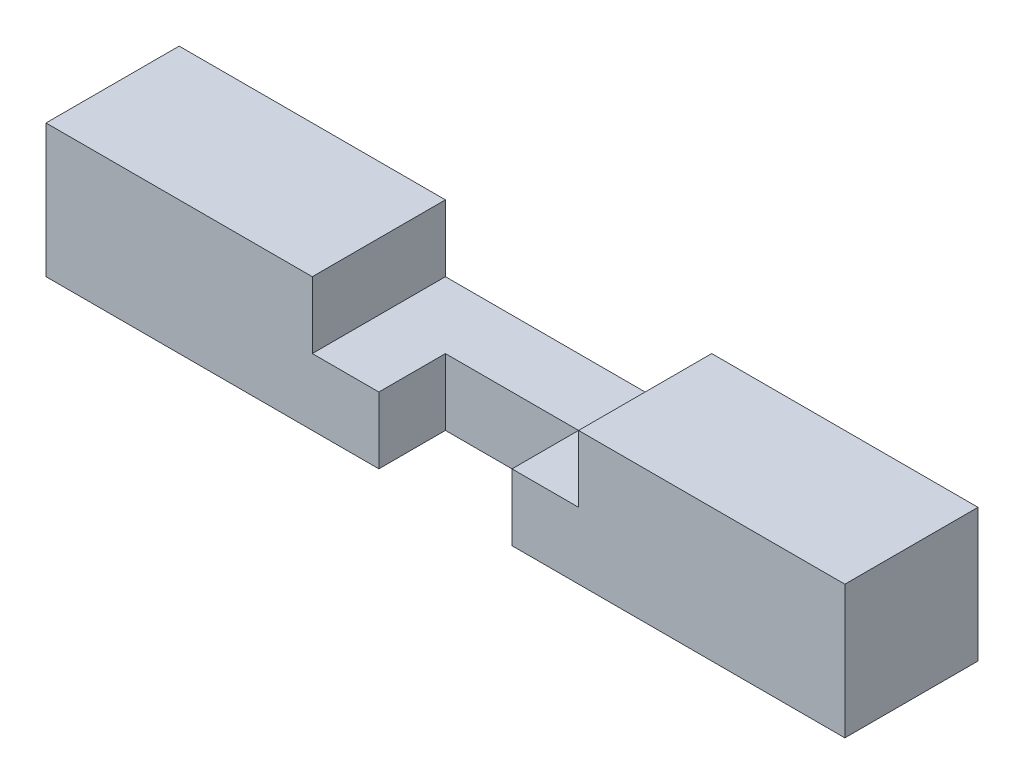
ISO-10303-21;
HEADER;
FILE_DESCRIPTION(('STEP AP214'),'2;1');
FILE_NAME('part.step','',(''),(''),'','','');
FILE_SCHEMA(('AUTOMOTIVE_DESIGN { 1 0 10303 214 1 1 1 1 }'));
ENDSEC;
DATA;
#1=APPLICATION_CONTEXT('core data for automotive mechanical design processes');
#2=APPLICATION_PROTOCOL_DEFINITION('international standard','automotive_design',2000,#1);
#3=PRODUCT_CONTEXT('',#1,'mechanical');
#4=PRODUCT('Part','Part','',(#3));
#5=PRODUCT_RELATED_PRODUCT_CATEGORY('part','',(#4));
#6=PRODUCT_DEFINITION_FORMATION('','',#4);
#7=PRODUCT_DEFINITION_CONTEXT('part definition',#1,'design');
#8=PRODUCT_DEFINITION('design','',#6,#7);
#9=PRODUCT_DEFINITION_SHAPE('','',#8);
#10=(LENGTH_UNIT() NAMED_UNIT(*) SI_UNIT(.MILLI.,.METRE.));
#11=(NAMED_UNIT(*) PLANE_ANGLE_UNIT() SI_UNIT($,.RADIAN.));
#12=(NAMED_UNIT(*) SI_UNIT($,.STERADIAN.) SOLID_ANGLE_UNIT());
#13=UNCERTAINTY_MEASURE_WITH_UNIT(LENGTH_MEASURE(1.E-05),#10,'distance_accuracy_value','');
#14=(GEOMETRIC_REPRESENTATION_CONTEXT(3) GLOBAL_UNCERTAINTY_ASSIGNED_CONTEXT((#13)) GLOBAL_UNIT_ASSIGNED_CONTEXT((#10,
#11,#12)) REPRESENTATION_CONTEXT('',''));
#15=CARTESIAN_POINT('',(0.,0.,0.));
#16=DIRECTION('',(0.,0.,1.));
#17=DIRECTION('',(1.,0.,0.));
#18=AXIS2_PLACEMENT_3D('',#15,#16,#17);
#19=CARTESIAN_POINT('',(0.,20.,0.));
#20=DIRECTION('',(0.,0.,-1.));
#21=DIRECTION('',(-1.,0.,0.));
#22=AXIS2_PLACEMENT_3D('',#19,#20,#21);
#23=PLANE('',#22);
#24=DIRECTION('',(1.,0.,0.));
#25=VECTOR('',#24,1.);
#26=CARTESIAN_POINT('',(0.,0.,0.));
#27=LINE('',#26,#25);
#28=CARTESIAN_POINT('',(0.,0.,0.));
#29=VERTEX_POINT('',#28);
#30=CARTESIAN_POINT('',(50.,0.,0.));
#31=VERTEX_POINT('',#30);
#32=EDGE_CURVE('E138',#29,#31,#27,.T.);
#33=ORIENTED_EDGE('',*,*,#32,.T.);
#34=DIRECTION('',(0.,1.,0.));
#35=VECTOR('',#34,1.);
#36=CARTESIAN_POINT('',(50.,0.,0.));
#37=LINE('',#36,#35);
#38=CARTESIAN_POINT('',(50.,10.,0.));
#39=VERTEX_POINT('',#38);
#40=EDGE_CURVE('E122',#31,#39,#37,.T.);
#41=ORIENTED_EDGE('',*,*,#40,.T.);
#42=DIRECTION('',(1.,0.,0.));
#43=VECTOR('',#42,1.);
#44=CARTESIAN_POINT('',(40.,10.,0.));
#45=LINE('',#44,#43);
#46=CARTESIAN_POINT('',(40.,10.,0.));
#47=VERTEX_POINT('',#46);
#48=EDGE_CURVE('E209',#47,#39,#45,.T.);
#49=ORIENTED_EDGE('',*,*,#48,.F.);
#50=DIRECTION('',(0.,-1.,0.));
#51=VECTOR('',#50,1.);
#52=CARTESIAN_POINT('',(40.,20.,0.));
#53=LINE('',#52,#51);
#54=CARTESIAN_POINT('',(40.,20.,0.));
#55=VERTEX_POINT('',#54);
#56=EDGE_CURVE('E214',#55,#47,#53,.T.);
#57=ORIENTED_EDGE('',*,*,#56,.F.);
#58=DIRECTION('',(1.,0.,0.));
#59=VECTOR('',#58,1.);
#60=CARTESIAN_POINT('',(0.,20.,0.));
#61=LINE('',#60,#59);
#62=CARTESIAN_POINT('',(0.,20.,0.));
#63=VERTEX_POINT('',#62);
#64=EDGE_CURVE('E187',#63,#55,#61,.T.);
#65=ORIENTED_EDGE('',*,*,#64,.F.);
#66=DIRECTION('',(0.,-1.,0.));
#67=VECTOR('',#66,1.);
#68=CARTESIAN_POINT('',(0.,20.,0.));
#69=LINE('',#68,#67);
#70=EDGE_CURVE('E11',#63,#29,#69,.T.);
#71=ORIENTED_EDGE('',*,*,#70,.T.);
#72=EDGE_LOOP('',(#33,#41,#49,#57,#65,#71));
#73=FACE_BOUND('',#72,.T.);
#74=ADVANCED_FACE('F31',(#73),#23,.F.);
#75=CARTESIAN_POINT('',(0.,20.,-20.));
#76=DIRECTION('',(0.,-1.,0.));
#77=DIRECTION('',(0.,0.,-1.));
#78=AXIS2_PLACEMENT_3D('',#75,#76,#77);
#79=PLANE('',#78);
#80=ORIENTED_EDGE('',*,*,#64,.T.);
#81=DIRECTION('',(0.,0.,1.));
#82=VECTOR('',#81,1.);
#83=CARTESIAN_POINT('',(40.,20.,-20.));
#84=LINE('',#83,#82);
#85=CARTESIAN_POINT('',(40.,20.,-20.));
#86=VERTEX_POINT('',#85);
#87=EDGE_CURVE('E198',#86,#55,#84,.T.);
#88=ORIENTED_EDGE('',*,*,#87,.F.);
#89=DIRECTION('',(-1.,0.,0.));
#90=VECTOR('',#89,1.);
#91=CARTESIAN_POINT('',(0.,20.,-20.));
#92=LINE('',#91,#90);
#93=CARTESIAN_POINT('',(0.,20.,-20.));
#94=VERTEX_POINT('',#93);
#95=EDGE_CURVE('E193',#86,#94,#92,.T.);
#96=ORIENTED_EDGE('',*,*,#95,.T.);
#97=DIRECTION('',(0.,0.,1.));
#98=VECTOR('',#97,1.);
#99=CARTESIAN_POINT('',(0.,20.,0.));
#100=LINE('',#99,#98);
#101=EDGE_CURVE('E156',#94,#63,#100,.T.);
#102=ORIENTED_EDGE('',*,*,#101,.T.);
#103=EDGE_LOOP('',(#80,#88,#96,#102));
#104=FACE_BOUND('',#103,.T.);
#105=ADVANCED_FACE('F197',(#104),#79,.F.);
#106=CARTESIAN_POINT('',(0.,20.,0.));
#107=DIRECTION('',(1.,0.,0.));
#108=DIRECTION('',(0.,0.,-1.));
#109=AXIS2_PLACEMENT_3D('',#106,#107,#108);
#110=PLANE('',#109);
#111=DIRECTION('',(0.,0.,1.));
#112=VECTOR('',#111,1.);
#113=CARTESIAN_POINT('',(0.,0.,0.));
#114=LINE('',#113,#112);
#115=CARTESIAN_POINT('',(0.,0.,-20.));
#116=VERTEX_POINT('',#115);
#117=EDGE_CURVE('E151',#116,#29,#114,.T.);
#118=ORIENTED_EDGE('',*,*,#117,.T.);
#119=ORIENTED_EDGE('',*,*,#70,.F.);
#120=ORIENTED_EDGE('',*,*,#101,.F.);
#121=DIRECTION('',(0.,-1.,0.));
#122=VECTOR('',#121,1.);
#123=CARTESIAN_POINT('',(0.,20.,-20.));
#124=LINE('',#123,#122);
#125=EDGE_CURVE('E157',#94,#116,#124,.T.);
#126=ORIENTED_EDGE('',*,*,#125,.T.);
#127=EDGE_LOOP('',(#118,#119,#120,#126));
#128=FACE_BOUND('',#127,.T.);
#129=ADVANCED_FACE('F33',(#128),#110,.F.);
#130=CARTESIAN_POINT('',(70.,10.,0.));
#131=VERTEX_POINT('',#130);
#132=CARTESIAN_POINT('',(80.,10.,0.));
#133=VERTEX_POINT('',#132);
#134=EDGE_CURVE('E217',#131,#133,#45,.T.);
#135=ORIENTED_EDGE('',*,*,#134,.F.);
#136=DIRECTION('',(0.,1.,0.));
#137=VECTOR('',#136,1.);
#138=CARTESIAN_POINT('',(70.,0.,0.));
#139=LINE('',#138,#137);
#140=CARTESIAN_POINT('',(70.,0.,0.));
#141=VERTEX_POINT('',#140);
#142=EDGE_CURVE('E46',#141,#131,#139,.T.);
#143=ORIENTED_EDGE('',*,*,#142,.F.);
#144=CARTESIAN_POINT('',(120.,0.,0.));
#145=VERTEX_POINT('',#144);
#146=EDGE_CURVE('E147',#141,#145,#27,.T.);
#147=ORIENTED_EDGE('',*,*,#146,.T.);
#148=DIRECTION('',(0.,-1.,0.));
#149=VECTOR('',#148,1.);
#150=CARTESIAN_POINT('',(120.,20.,0.));
#151=LINE('',#150,#149);
#152=CARTESIAN_POINT('',(120.,20.,0.));
#153=VERTEX_POINT('',#152);
#154=EDGE_CURVE('E39',#153,#145,#151,.T.);
#155=ORIENTED_EDGE('',*,*,#154,.F.);
#156=CARTESIAN_POINT('',(80.,20.,0.));
#157=VERTEX_POINT('',#156);
#158=EDGE_CURVE('E185',#157,#153,#61,.T.);
#159=ORIENTED_EDGE('',*,*,#158,.F.);
#160=DIRECTION('',(0.,1.,0.));
#161=VECTOR('',#160,1.);
#162=CARTESIAN_POINT('',(80.,20.,0.));
#163=LINE('',#162,#161);
#164=EDGE_CURVE('E54',#133,#157,#163,.T.);
#165=ORIENTED_EDGE('',*,*,#164,.F.);
#166=EDGE_LOOP('',(#135,#143,#147,#155,#159,#165));
#167=FACE_BOUND('',#166,.T.);
#168=ADVANCED_FACE('F241',(#167),#23,.F.);
#169=CARTESIAN_POINT('',(120.,20.,0.));
#170=DIRECTION('',(-1.,0.,0.));
#171=DIRECTION('',(0.,0.,1.));
#172=AXIS2_PLACEMENT_3D('',#169,#170,#171);
#173=PLANE('',#172);
#174=DIRECTION('',(0.,0.,-1.));
#175=VECTOR('',#174,1.);
#176=CARTESIAN_POINT('',(120.,0.,0.));
#177=LINE('',#176,#175);
#178=CARTESIAN_POINT('',(120.,0.,-20.));
#179=VERTEX_POINT('',#178);
#180=EDGE_CURVE('E146',#145,#179,#177,.T.);
#181=ORIENTED_EDGE('',*,*,#180,.T.);
#182=DIRECTION('',(0.,-1.,0.));
#183=VECTOR('',#182,1.);
#184=CARTESIAN_POINT('',(120.,20.,-20.));
#185=LINE('',#184,#183);
#186=CARTESIAN_POINT('',(120.,20.,-20.));
#187=VERTEX_POINT('',#186);
#188=EDGE_CURVE('E160',#187,#179,#185,.T.);
#189=ORIENTED_EDGE('',*,*,#188,.F.);
#190=DIRECTION('',(0.,0.,-1.));
#191=VECTOR('',#190,1.);
#192=CARTESIAN_POINT('',(120.,20.,0.));
#193=LINE('',#192,#191);
#194=EDGE_CURVE('E170',#153,#187,#193,.T.);
#195=ORIENTED_EDGE('',*,*,#194,.F.);
#196=ORIENTED_EDGE('',*,*,#154,.T.);
#197=EDGE_LOOP('',(#181,#189,#195,#196));
#198=FACE_BOUND('',#197,.T.);
#199=ADVANCED_FACE('F168',(#198),#173,.F.);
#200=CARTESIAN_POINT('',(0.,20.,-20.));
#201=DIRECTION('',(0.,0.,1.));
#202=DIRECTION('',(1.,0.,0.));
#203=AXIS2_PLACEMENT_3D('',#200,#201,#202);
#204=PLANE('',#203);
#205=ORIENTED_EDGE('',*,*,#95,.F.);
#206=DIRECTION('',(0.,-1.,0.));
#207=VECTOR('',#206,1.);
#208=CARTESIAN_POINT('',(40.,20.,-20.));
#209=LINE('',#208,#207);
#210=CARTESIAN_POINT('',(40.,10.,-20.));
#211=VERTEX_POINT('',#210);
#212=EDGE_CURVE('E201',#86,#211,#209,.T.);
#213=ORIENTED_EDGE('',*,*,#212,.T.);
#214=DIRECTION('',(1.,0.,0.));
#215=VECTOR('',#214,1.);
#216=CARTESIAN_POINT('',(40.,10.,-20.));
#217=LINE('',#216,#215);
#218=CARTESIAN_POINT('',(80.,10.,-20.));
#219=VERTEX_POINT('',#218);
#220=EDGE_CURVE('E204',#211,#219,#217,.T.);
#221=ORIENTED_EDGE('',*,*,#220,.T.);
#222=DIRECTION('',(0.,1.,0.));
#223=VECTOR('',#222,1.);
#224=CARTESIAN_POINT('',(80.,20.,-20.));
#225=LINE('',#224,#223);
#226=CARTESIAN_POINT('',(80.,20.,-20.));
#227=VERTEX_POINT('',#226);
#228=EDGE_CURVE('E207',#219,#227,#225,.T.);
#229=ORIENTED_EDGE('',*,*,#228,.T.);
#230=EDGE_CURVE('E161',#187,#227,#92,.T.);
#231=ORIENTED_EDGE('',*,*,#230,.F.);
#232=ORIENTED_EDGE('',*,*,#188,.T.);
#233=DIRECTION('',(-1.,0.,0.));
#234=VECTOR('',#233,1.);
#235=CARTESIAN_POINT('',(0.,0.,-20.));
#236=LINE('',#235,#234);
#237=EDGE_CURVE('E149',#179,#116,#236,.T.);
#238=ORIENTED_EDGE('',*,*,#237,.T.);
#239=ORIENTED_EDGE('',*,*,#125,.F.);
#240=EDGE_LOOP('',(#205,#213,#221,#229,#231,#232,#238,#239));
#241=FACE_BOUND('',#240,.T.);
#242=ADVANCED_FACE('F178',(#241),#204,.F.);
#243=ORIENTED_EDGE('',*,*,#230,.T.);
#244=DIRECTION('',(0.,0.,1.));
#245=VECTOR('',#244,1.);
#246=CARTESIAN_POINT('',(80.,20.,-20.));
#247=LINE('',#246,#245);
#248=EDGE_CURVE('E221',#227,#157,#247,.T.);
#249=ORIENTED_EDGE('',*,*,#248,.T.);
#250=ORIENTED_EDGE('',*,*,#158,.T.);
#251=ORIENTED_EDGE('',*,*,#194,.T.);
#252=EDGE_LOOP('',(#243,#249,#250,#251));
#253=FACE_BOUND('',#252,.T.);
#254=ADVANCED_FACE('F236',(#253),#79,.F.);
#255=CARTESIAN_POINT('',(0.,0.,-20.));
#256=DIRECTION('',(0.,-1.,0.));
#257=DIRECTION('',(0.,0.,-1.));
#258=AXIS2_PLACEMENT_3D('',#255,#256,#257);
#259=PLANE('',#258);
#260=DIRECTION('',(0.,0.,1.));
#261=VECTOR('',#260,1.);
#262=CARTESIAN_POINT('',(50.,0.,0.));
#263=LINE('',#262,#261);
#264=CARTESIAN_POINT('',(50.,0.,-10.));
#265=VERTEX_POINT('',#264);
#266=EDGE_CURVE('E125',#265,#31,#263,.T.);
#267=ORIENTED_EDGE('',*,*,#266,.T.);
#268=ORIENTED_EDGE('',*,*,#32,.F.);
#269=ORIENTED_EDGE('',*,*,#117,.F.);
#270=ORIENTED_EDGE('',*,*,#237,.F.);
#271=ORIENTED_EDGE('',*,*,#180,.F.);
#272=ORIENTED_EDGE('',*,*,#146,.F.);
#273=DIRECTION('',(0.,0.,-1.));
#274=VECTOR('',#273,1.);
#275=CARTESIAN_POINT('',(70.,0.,0.));
#276=LINE('',#275,#274);
#277=CARTESIAN_POINT('',(70.,0.,-10.));
#278=VERTEX_POINT('',#277);
#279=EDGE_CURVE('E141',#141,#278,#276,.T.);
#280=ORIENTED_EDGE('',*,*,#279,.T.);
#281=DIRECTION('',(-1.,0.,0.));
#282=VECTOR('',#281,1.);
#283=CARTESIAN_POINT('',(50.,0.,-10.));
#284=LINE('',#283,#282);
#285=EDGE_CURVE('E133',#278,#265,#284,.T.);
#286=ORIENTED_EDGE('',*,*,#285,.T.);
#287=EDGE_LOOP('',(#267,#268,#269,#270,#271,#272,#280,#286));
#288=FACE_BOUND('',#287,.T.);
#289=ADVANCED_FACE('F136',(#288),#259,.T.);
#290=CARTESIAN_POINT('',(40.,20.,-20.));
#291=DIRECTION('',(-1.,0.,0.));
#292=DIRECTION('',(0.,0.,1.));
#293=AXIS2_PLACEMENT_3D('',#290,#291,#292);
#294=PLANE('',#293);
#295=ORIENTED_EDGE('',*,*,#56,.T.);
#296=DIRECTION('',(0.,0.,1.));
#297=VECTOR('',#296,1.);
#298=CARTESIAN_POINT('',(40.,10.,-20.));
#299=LINE('',#298,#297);
#300=EDGE_CURVE('E190',#211,#47,#299,.T.);
#301=ORIENTED_EDGE('',*,*,#300,.F.);
#302=ORIENTED_EDGE('',*,*,#212,.F.);
#303=ORIENTED_EDGE('',*,*,#87,.T.);
#304=EDGE_LOOP('',(#295,#301,#302,#303));
#305=FACE_BOUND('',#304,.T.);
#306=ADVANCED_FACE('F227',(#305),#294,.F.);
#307=CARTESIAN_POINT('',(80.,20.,-20.));
#308=DIRECTION('',(1.,0.,0.));
#309=DIRECTION('',(0.,0.,-1.));
#310=AXIS2_PLACEMENT_3D('',#307,#308,#309);
#311=PLANE('',#310);
#312=ORIENTED_EDGE('',*,*,#164,.T.);
#313=ORIENTED_EDGE('',*,*,#248,.F.);
#314=ORIENTED_EDGE('',*,*,#228,.F.);
#315=DIRECTION('',(0.,0.,1.));
#316=VECTOR('',#315,1.);
#317=CARTESIAN_POINT('',(80.,10.,-20.));
#318=LINE('',#317,#316);
#319=EDGE_CURVE('E222',#219,#133,#318,.T.);
#320=ORIENTED_EDGE('',*,*,#319,.T.);
#321=EDGE_LOOP('',(#312,#313,#314,#320));
#322=FACE_BOUND('',#321,.T.);
#323=ADVANCED_FACE('F229',(#322),#311,.F.);
#324=CARTESIAN_POINT('',(40.,10.,-20.));
#325=DIRECTION('',(0.,-1.,0.));
#326=DIRECTION('',(0.,0.,-1.));
#327=AXIS2_PLACEMENT_3D('',#324,#325,#326);
#328=PLANE('',#327);
#329=ORIENTED_EDGE('',*,*,#48,.T.);
#330=DIRECTION('',(0.,0.,1.));
#331=VECTOR('',#330,1.);
#332=CARTESIAN_POINT('',(50.,10.,0.));
#333=LINE('',#332,#331);
#334=CARTESIAN_POINT('',(50.,10.,-10.));
#335=VERTEX_POINT('',#334);
#336=EDGE_CURVE('E128',#335,#39,#333,.T.);
#337=ORIENTED_EDGE('',*,*,#336,.F.);
#338=DIRECTION('',(-1.,0.,0.));
#339=VECTOR('',#338,1.);
#340=CARTESIAN_POINT('',(50.,10.,-10.));
#341=LINE('',#340,#339);
#342=CARTESIAN_POINT('',(70.,10.,-10.));
#343=VERTEX_POINT('',#342);
#344=EDGE_CURVE('E142',#343,#335,#341,.T.);
#345=ORIENTED_EDGE('',*,*,#344,.F.);
#346=DIRECTION('',(0.,0.,-1.));
#347=VECTOR('',#346,1.);
#348=CARTESIAN_POINT('',(70.,10.,0.));
#349=LINE('',#348,#347);
#350=EDGE_CURVE('E253',#131,#343,#349,.T.);
#351=ORIENTED_EDGE('',*,*,#350,.F.);
#352=ORIENTED_EDGE('',*,*,#134,.T.);
#353=ORIENTED_EDGE('',*,*,#319,.F.);
#354=ORIENTED_EDGE('',*,*,#220,.F.);
#355=ORIENTED_EDGE('',*,*,#300,.T.);
#356=EDGE_LOOP('',(#329,#337,#345,#351,#352,#353,#354,#355));
#357=FACE_BOUND('',#356,.T.);
#358=ADVANCED_FACE('F225',(#357),#328,.F.);
#359=CARTESIAN_POINT('',(50.,0.,0.));
#360=DIRECTION('',(-1.,0.,0.));
#361=DIRECTION('',(0.,0.,1.));
#362=AXIS2_PLACEMENT_3D('',#359,#360,#361);
#363=PLANE('',#362);
#364=ORIENTED_EDGE('',*,*,#336,.T.);
#365=ORIENTED_EDGE('',*,*,#40,.F.);
#366=ORIENTED_EDGE('',*,*,#266,.F.);
#367=DIRECTION('',(0.,1.,0.));
#368=VECTOR('',#367,1.);
#369=CARTESIAN_POINT('',(50.,0.,-10.));
#370=LINE('',#369,#368);
#371=EDGE_CURVE('E218',#265,#335,#370,.T.);
#372=ORIENTED_EDGE('',*,*,#371,.T.);
#373=EDGE_LOOP('',(#364,#365,#366,#372));
#374=FACE_BOUND('',#373,.T.);
#375=ADVANCED_FACE('F124',(#374),#363,.F.);
#376=CARTESIAN_POINT('',(50.,0.,-10.));
#377=DIRECTION('',(0.,0.,-1.));
#378=DIRECTION('',(-1.,0.,0.));
#379=AXIS2_PLACEMENT_3D('',#376,#377,#378);
#380=PLANE('',#379);
#381=ORIENTED_EDGE('',*,*,#344,.T.);
#382=ORIENTED_EDGE('',*,*,#371,.F.);
#383=ORIENTED_EDGE('',*,*,#285,.F.);
#384=DIRECTION('',(0.,1.,0.));
#385=VECTOR('',#384,1.);
#386=CARTESIAN_POINT('',(70.,0.,-10.));
#387=LINE('',#386,#385);
#388=EDGE_CURVE('E261',#278,#343,#387,.T.);
#389=ORIENTED_EDGE('',*,*,#388,.T.);
#390=EDGE_LOOP('',(#381,#382,#383,#389));
#391=FACE_BOUND('',#390,.T.);
#392=ADVANCED_FACE('F263',(#391),#380,.F.);
#393=CARTESIAN_POINT('',(70.,0.,0.));
#394=DIRECTION('',(1.,0.,0.));
#395=DIRECTION('',(0.,0.,-1.));
#396=AXIS2_PLACEMENT_3D('',#393,#394,#395);
#397=PLANE('',#396);
#398=ORIENTED_EDGE('',*,*,#350,.T.);
#399=ORIENTED_EDGE('',*,*,#388,.F.);
#400=ORIENTED_EDGE('',*,*,#279,.F.);
#401=ORIENTED_EDGE('',*,*,#142,.T.);
#402=EDGE_LOOP('',(#398,#399,#400,#401));
#403=FACE_BOUND('',#402,.T.);
#404=ADVANCED_FACE('F264',(#403),#397,.F.);
#405=CLOSED_SHELL('',(#74,#105,#129,#168,#199,#242,#254,#289,#306,#323,#358,#375,#392,#404));
#406=MANIFOLD_SOLID_BREP('B2',#405);
#407=ADVANCED_BREP_SHAPE_REPRESENTATION('',(#18,#406),#14);
#408=SHAPE_DEFINITION_REPRESENTATION(#9,#407);
ENDSEC;
END-ISO-10303-21;
